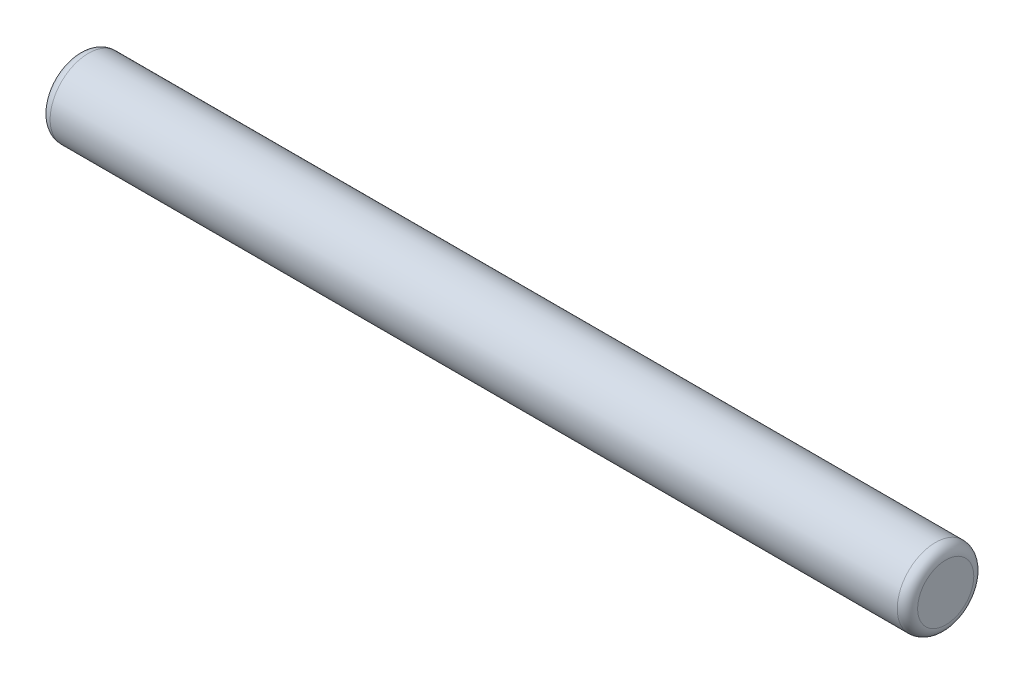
from build123d import *

# Parameters (mm, degrees)
SKETCH1_R           = 4.7625
BOSS_EXTRUDE1_DEPTH = 107.95
FILLET1_R           = 1.27


with BuildPart() as part:
    # Sketch1 → Boss-Extrude1 (new body)
    with BuildSketch(Plane(origin=(0, 0, 0), x_dir=(0, 0, -1), z_dir=(1, 0, 0))):
        Circle(SKETCH1_R)
    extrude(amount=BOSS_EXTRUDE1_DEPTH)

    # Fillet1
    fillet1_edges = [part.edges().sort_by_distance(p)[0] for p in [
        (0, 0, 4.7625),
        (107.95, 0, 4.7625),
    ]]
    fillet(fillet1_edges, radius=FILLET1_R)


solid = part.part
